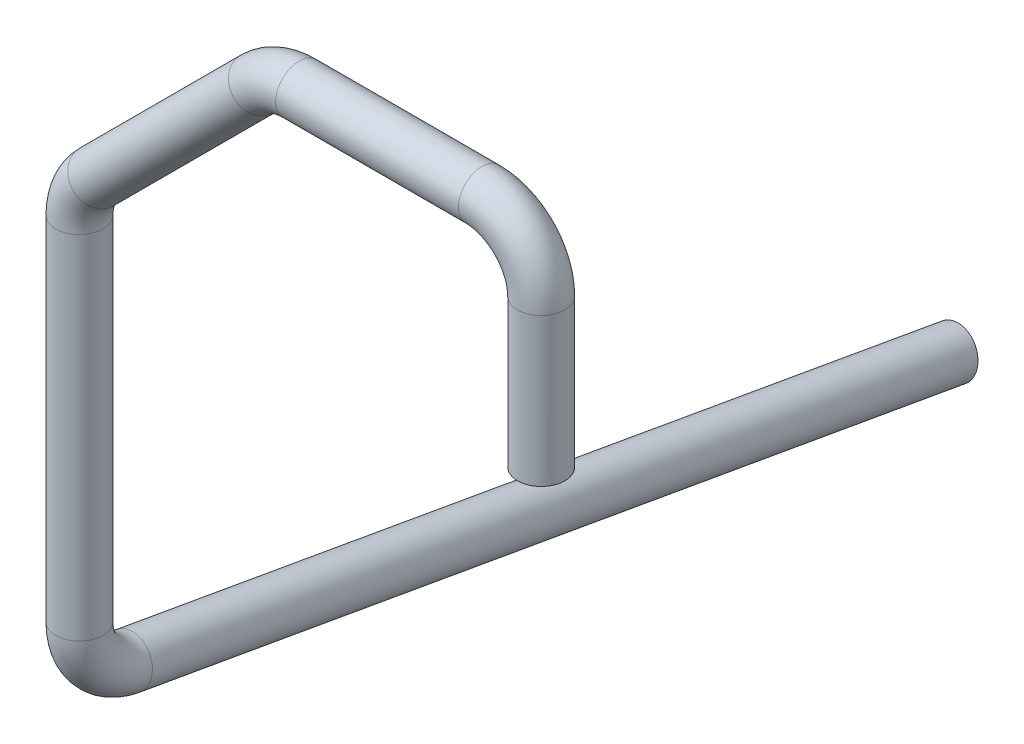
ISO-10303-21;
HEADER;
FILE_DESCRIPTION(('STEP AP214'),'2;1');
FILE_NAME('part.step','',(''),(''),'','','');
FILE_SCHEMA(('AUTOMOTIVE_DESIGN { 1 0 10303 214 1 1 1 1 }'));
ENDSEC;
DATA;
#1=APPLICATION_CONTEXT('core data for automotive mechanical design processes');
#2=APPLICATION_PROTOCOL_DEFINITION('international standard','automotive_design',2000,#1);
#3=PRODUCT_CONTEXT('',#1,'mechanical');
#4=PRODUCT('Part','Part','',(#3));
#5=PRODUCT_RELATED_PRODUCT_CATEGORY('part','',(#4));
#6=PRODUCT_DEFINITION_FORMATION('','',#4);
#7=PRODUCT_DEFINITION_CONTEXT('part definition',#1,'design');
#8=PRODUCT_DEFINITION('design','',#6,#7);
#9=PRODUCT_DEFINITION_SHAPE('','',#8);
#10=(LENGTH_UNIT() NAMED_UNIT(*) SI_UNIT(.MILLI.,.METRE.));
#11=(NAMED_UNIT(*) PLANE_ANGLE_UNIT() SI_UNIT($,.RADIAN.));
#12=(NAMED_UNIT(*) SI_UNIT($,.STERADIAN.) SOLID_ANGLE_UNIT());
#13=UNCERTAINTY_MEASURE_WITH_UNIT(LENGTH_MEASURE(1.E-05),#10,'distance_accuracy_value','');
#14=(GEOMETRIC_REPRESENTATION_CONTEXT(3) GLOBAL_UNCERTAINTY_ASSIGNED_CONTEXT((#13)) GLOBAL_UNIT_ASSIGNED_CONTEXT((#10,
#11,#12)) REPRESENTATION_CONTEXT('',''));
#15=CARTESIAN_POINT('',(0.,0.,0.));
#16=DIRECTION('',(0.,0.,1.));
#17=DIRECTION('',(1.,0.,0.));
#18=AXIS2_PLACEMENT_3D('',#15,#16,#17);
#19=CARTESIAN_POINT('',(0.,0.,0.));
#20=DIRECTION('',(0.,1.,0.));
#21=DIRECTION('',(0.,0.,1.));
#22=AXIS2_PLACEMENT_3D('',#19,#20,#21);
#23=CYLINDRICAL_SURFACE('',#22,4.);
#24=CARTESIAN_POINT('',(0.,24.9999999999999,0.));
#25=DIRECTION('',(0.,1.,0.));
#26=DIRECTION('',(0.,0.,1.));
#27=AXIS2_PLACEMENT_3D('',#24,#25,#26);
#28=CIRCLE('',#27,4.);
#29=CARTESIAN_POINT('',(4.,24.9999999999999,0.));
#30=VERTEX_POINT('',#29);
#31=EDGE_CURVE('E108',#30,#30,#28,.T.);
#32=ORIENTED_EDGE('',*,*,#31,.F.);
#33=EDGE_LOOP('',(#32));
#34=FACE_BOUND('',#33,.T.);
#35=CARTESIAN_POINT('',(0.,0.,0.));
#36=DIRECTION('',(0.,1.,0.));
#37=DIRECTION('',(0.,0.,1.));
#38=AXIS2_PLACEMENT_3D('',#35,#36,#37);
#39=CIRCLE('',#38,4.);
#40=CARTESIAN_POINT('',(0.,0.,3.99999999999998));
#41=VERTEX_POINT('',#40);
#42=EDGE_CURVE('E69',#41,#41,#39,.T.);
#43=ORIENTED_EDGE('',*,*,#42,.T.);
#44=EDGE_LOOP('',(#43));
#45=FACE_BOUND('',#44,.T.);
#46=ADVANCED_FACE('F50',(#34,#45),#23,.T.);
#47=CARTESIAN_POINT('',(-10.,25.,1.11022302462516E-13));
#48=DIRECTION('',(0.,0.,1.));
#49=DIRECTION('',(1.,0.,0.));
#50=AXIS2_PLACEMENT_3D('',#47,#48,#49);
#51=TOROIDAL_SURFACE('',#50,10.,4.);
#52=CARTESIAN_POINT('',(-10.0000000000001,35.,0.));
#53=DIRECTION('',(-1.,0.,0.));
#54=DIRECTION('',(0.,0.,1.));
#55=AXIS2_PLACEMENT_3D('',#52,#53,#54);
#56=CIRCLE('',#55,4.);
#57=CARTESIAN_POINT('',(-10.0000000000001,39.,0.));
#58=VERTEX_POINT('',#57);
#59=EDGE_CURVE('E112',#58,#58,#56,.T.);
#60=CARTESIAN_POINT('',(-10.,25.,1.11022302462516E-13));
#61=DIRECTION('',(0.,0.,1.));
#62=DIRECTION('',(1.,0.,0.));
#63=AXIS2_PLACEMENT_3D('',#60,#61,#62);
#64=CIRCLE('',#63,14.);
#65=EDGE_CURVE('',#30,#58,#64,.T.);
#66=ORIENTED_EDGE('',*,*,#31,.T.);
#67=ORIENTED_EDGE('',*,*,#59,.F.);
#68=ORIENTED_EDGE('',*,*,#65,.T.);
#69=ORIENTED_EDGE('',*,*,#65,.F.);
#70=EDGE_LOOP('',(#66,#68,#67,#69));
#71=FACE_BOUND('',#70,.T.);
#72=ADVANCED_FACE('F166',(#71),#51,.T.);
#73=CARTESIAN_POINT('',(-10.0000000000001,35.,0.));
#74=DIRECTION('',(-1.,0.,0.));
#75=DIRECTION('',(0.,0.,1.));
#76=AXIS2_PLACEMENT_3D('',#73,#74,#75);
#77=CYLINDRICAL_SURFACE('',#76,4.);
#78=CARTESIAN_POINT('',(-40.857864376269,34.9999999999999,0.));
#79=DIRECTION('',(-1.,0.,0.));
#80=DIRECTION('',(0.,0.,1.));
#81=AXIS2_PLACEMENT_3D('',#78,#79,#80);
#82=CIRCLE('',#81,4.);
#83=CARTESIAN_POINT('',(-40.857864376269,39.,0.));
#84=VERTEX_POINT('',#83);
#85=EDGE_CURVE('E115',#84,#84,#82,.T.);
#86=ORIENTED_EDGE('',*,*,#85,.F.);
#87=EDGE_LOOP('',(#86));
#88=FACE_BOUND('',#87,.T.);
#89=ORIENTED_EDGE('',*,*,#59,.T.);
#90=EDGE_LOOP('',(#89));
#91=FACE_BOUND('',#90,.T.);
#92=ADVANCED_FACE('F162',(#88,#91),#77,.T.);
#93=CARTESIAN_POINT('',(-40.857864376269,25.,1.66533453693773E-13));
#94=DIRECTION('',(0.,0.,1.));
#95=DIRECTION('',(1.,0.,0.));
#96=AXIS2_PLACEMENT_3D('',#93,#94,#95);
#97=TOROIDAL_SURFACE('',#96,10.,4.);
#98=CARTESIAN_POINT('',(-47.9289321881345,32.0710678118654,0.));
#99=DIRECTION('',(-0.707106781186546,-0.70710678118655,0.));
#100=DIRECTION('',(0.,0.,1.));
#101=AXIS2_PLACEMENT_3D('',#98,#99,#100);
#102=CIRCLE('',#101,4.);
#103=CARTESIAN_POINT('',(-50.7573593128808,34.8994949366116,0.));
#104=VERTEX_POINT('',#103);
#105=EDGE_CURVE('E119',#104,#104,#102,.T.);
#106=CARTESIAN_POINT('',(-40.857864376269,25.,1.66533453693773E-13));
#107=DIRECTION('',(0.,0.,1.));
#108=DIRECTION('',(1.,0.,0.));
#109=AXIS2_PLACEMENT_3D('',#106,#107,#108);
#110=CIRCLE('',#109,14.);
#111=EDGE_CURVE('',#84,#104,#110,.T.);
#112=ORIENTED_EDGE('',*,*,#85,.T.);
#113=ORIENTED_EDGE('',*,*,#105,.F.);
#114=ORIENTED_EDGE('',*,*,#111,.T.);
#115=ORIENTED_EDGE('',*,*,#111,.F.);
#116=EDGE_LOOP('',(#112,#114,#113,#115));
#117=FACE_BOUND('',#116,.T.);
#118=ADVANCED_FACE('F158',(#117),#97,.T.);
#119=CARTESIAN_POINT('',(-47.9289321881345,32.0710678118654,0.));
#120=DIRECTION('',(-0.707106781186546,-0.70710678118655,0.));
#121=DIRECTION('',(0.707106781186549,-0.707106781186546,0.));
#122=AXIS2_PLACEMENT_3D('',#119,#120,#121);
#123=CYLINDRICAL_SURFACE('',#122,4.);
#124=CARTESIAN_POINT('',(-75.0710678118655,4.92893218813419,0.));
#125=DIRECTION('',(-0.707106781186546,-0.70710678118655,0.));
#126=DIRECTION('',(0.,0.,1.));
#127=AXIS2_PLACEMENT_3D('',#124,#125,#126);
#128=CIRCLE('',#127,4.);
#129=CARTESIAN_POINT('',(-77.8994949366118,7.75735931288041,-1.27675647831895E-13));
#130=VERTEX_POINT('',#129);
#131=EDGE_CURVE('E123',#130,#130,#128,.T.);
#132=ORIENTED_EDGE('',*,*,#131,.F.);
#133=EDGE_LOOP('',(#132));
#134=FACE_BOUND('',#133,.T.);
#135=ORIENTED_EDGE('',*,*,#105,.T.);
#136=EDGE_LOOP('',(#135));
#137=FACE_BOUND('',#136,.T.);
#138=ADVANCED_FACE('F154',(#134,#137),#123,.T.);
#139=CARTESIAN_POINT('',(-68.,-2.14213562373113,0.));
#140=DIRECTION('',(0.,0.,1.));
#141=DIRECTION('',(1.,0.,0.));
#142=AXIS2_PLACEMENT_3D('',#139,#140,#141);
#143=TOROIDAL_SURFACE('',#142,10.,4.);
#144=CARTESIAN_POINT('',(-78.,-2.14213562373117,0.));
#145=DIRECTION('',(0.,-1.,0.));
#146=DIRECTION('',(0.,0.,1.));
#147=AXIS2_PLACEMENT_3D('',#144,#145,#146);
#148=CIRCLE('',#147,4.);
#149=CARTESIAN_POINT('',(-82.,-2.14213562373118,1.0547118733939E-13));
#150=VERTEX_POINT('',#149);
#151=EDGE_CURVE('E127',#150,#150,#148,.T.);
#152=CARTESIAN_POINT('',(-68.,-2.14213562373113,0.));
#153=DIRECTION('',(0.,0.,1.));
#154=DIRECTION('',(1.,0.,0.));
#155=AXIS2_PLACEMENT_3D('',#152,#153,#154);
#156=CIRCLE('',#155,14.);
#157=EDGE_CURVE('',#130,#150,#156,.T.);
#158=ORIENTED_EDGE('',*,*,#131,.T.);
#159=ORIENTED_EDGE('',*,*,#151,.F.);
#160=ORIENTED_EDGE('',*,*,#157,.T.);
#161=ORIENTED_EDGE('',*,*,#157,.F.);
#162=EDGE_LOOP('',(#158,#160,#159,#161));
#163=FACE_BOUND('',#162,.T.);
#164=ADVANCED_FACE('F148',(#163),#143,.T.);
#165=CARTESIAN_POINT('',(-78.,-2.14213562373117,0.));
#166=DIRECTION('',(0.,-1.,0.));
#167=DIRECTION('',(0.,0.,-1.));
#168=AXIS2_PLACEMENT_3D('',#165,#166,#167);
#169=CYLINDRICAL_SURFACE('',#168,4.);
#170=CARTESIAN_POINT('',(-78.,-61.6090036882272,1.38777878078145E-13));
#171=DIRECTION('',(0.,-1.,0.));
#172=DIRECTION('',(0.,0.,1.));
#173=AXIS2_PLACEMENT_3D('',#170,#171,#172);
#174=CIRCLE('',#173,4.);
#175=CARTESIAN_POINT('',(-78.0000000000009,-61.6090036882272,4.00000000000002));
#176=VERTEX_POINT('',#175);
#177=EDGE_CURVE('E130',#176,#176,#174,.T.);
#178=ORIENTED_EDGE('',*,*,#177,.F.);
#179=EDGE_LOOP('',(#178));
#180=FACE_BOUND('',#179,.T.);
#181=ORIENTED_EDGE('',*,*,#151,.T.);
#182=EDGE_LOOP('',(#181));
#183=FACE_BOUND('',#182,.T.);
#184=ADVANCED_FACE('F142',(#180,#183),#169,.T.);
#185=CARTESIAN_POINT('',(-77.9999999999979,-61.6090036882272,-9.99999999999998));
#186=DIRECTION('',(1.,0.,2.05370082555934E-13));
#187=DIRECTION('',(2.05412436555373E-13,0.,-1.));
#188=AXIS2_PLACEMENT_3D('',#185,#186,#187);
#189=TOROIDAL_SURFACE('',#188,10.,4.);
#190=CARTESIAN_POINT('',(-77.9999999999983,-71.4570812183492,-8.26351822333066));
#191=DIRECTION('',(2.02171608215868E-13,-0.17364817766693,-0.984807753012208));
#192=DIRECTION('',(1.69040349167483E-13,-0.984807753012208,0.17364817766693));
#193=AXIS2_PLACEMENT_3D('',#190,#191,#192);
#194=CIRCLE('',#193,4.);
#195=CARTESIAN_POINT('',(-77.9999999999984,-75.3963122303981,-7.56892551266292));
#196=VERTEX_POINT('',#195);
#197=EDGE_CURVE('E54',#196,#196,#194,.T.);
#198=CARTESIAN_POINT('',(-77.9999999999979,-61.6090036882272,-9.99999999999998));
#199=DIRECTION('',(1.,0.,2.05370082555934E-13));
#200=DIRECTION('',(2.05412436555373E-13,0.,-1.));
#201=AXIS2_PLACEMENT_3D('',#198,#199,#200);
#202=CIRCLE('',#201,14.);
#203=EDGE_CURVE('',#176,#196,#202,.T.);
#204=ORIENTED_EDGE('',*,*,#177,.T.);
#205=ORIENTED_EDGE('',*,*,#197,.F.);
#206=ORIENTED_EDGE('',*,*,#203,.T.);
#207=ORIENTED_EDGE('',*,*,#203,.F.);
#208=EDGE_LOOP('',(#204,#206,#205,#207));
#209=FACE_BOUND('',#208,.T.);
#210=ADVANCED_FACE('F140',(#209),#189,.T.);
#211=CARTESIAN_POINT('',(-77.9999999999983,-71.4570812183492,-8.26351822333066));
#212=DIRECTION('',(2.02392733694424E-13,-0.173648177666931,-0.984807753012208));
#213=DIRECTION('',(0.,0.984807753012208,-0.17364817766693));
#214=AXIS2_PLACEMENT_3D('',#211,#212,#213);
#215=CYLINDRICAL_SURFACE('',#214,4.);
#216=CARTESIAN_POINT('',(-77.9999999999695,-96.0472266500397,-147.721162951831));
#217=DIRECTION('',(2.02392733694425E-13,-0.173648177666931,-0.984807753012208));
#218=DIRECTION('',(1.69040349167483E-13,-0.984807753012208,0.17364817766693));
#219=AXIS2_PLACEMENT_3D('',#216,#217,#218);
#220=CIRCLE('',#219,4.);
#221=CARTESIAN_POINT('',(-77.9999999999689,-99.9864576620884,-147.026570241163));
#222=VERTEX_POINT('',#221);
#223=EDGE_CURVE('E75',#222,#222,#220,.T.);
#224=ORIENTED_EDGE('',*,*,#223,.F.);
#225=EDGE_LOOP('',(#224));
#226=FACE_BOUND('',#225,.T.);
#227=ORIENTED_EDGE('',*,*,#197,.T.);
#228=EDGE_LOOP('',(#227));
#229=FACE_BOUND('',#228,.T.);
#230=ADVANCED_FACE('F52',(#226,#229),#215,.T.);
#231=CARTESIAN_POINT('',(0.,0.,0.));
#232=DIRECTION('',(0.,1.,0.));
#233=DIRECTION('',(0.,0.,1.));
#234=AXIS2_PLACEMENT_3D('',#231,#232,#233);
#235=PLANE('',#234);
#236=CARTESIAN_POINT('',(0.,0.,0.));
#237=DIRECTION('',(0.,1.,0.));
#238=DIRECTION('',(0.,0.,1.));
#239=AXIS2_PLACEMENT_3D('',#236,#237,#238);
#240=CIRCLE('',#239,3.5);
#241=CARTESIAN_POINT('',(0.,0.,3.5));
#242=VERTEX_POINT('',#241);
#243=EDGE_CURVE('E105',#242,#242,#240,.F.);
#244=ORIENTED_EDGE('',*,*,#243,.F.);
#245=EDGE_LOOP('',(#244));
#246=FACE_BOUND('',#245,.T.);
#247=ORIENTED_EDGE('',*,*,#42,.F.);
#248=EDGE_LOOP('',(#247));
#249=FACE_BOUND('',#248,.T.);
#250=ADVANCED_FACE('F147',(#246,#249),#235,.F.);
#251=CARTESIAN_POINT('',(-77.9999999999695,-96.0472266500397,-147.721162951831));
#252=DIRECTION('',(2.02392733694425E-13,-0.173648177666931,-0.984807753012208));
#253=DIRECTION('',(1.69040349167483E-13,-0.984807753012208,0.17364817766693));
#254=AXIS2_PLACEMENT_3D('',#251,#252,#253);
#255=PLANE('',#254);
#256=CARTESIAN_POINT('',(-77.9999999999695,-96.0472266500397,-147.721162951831));
#257=DIRECTION('',(2.02392733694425E-13,-0.173648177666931,-0.984807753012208));
#258=DIRECTION('',(1.69040349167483E-13,-0.984807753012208,0.17364817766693));
#259=AXIS2_PLACEMENT_3D('',#256,#257,#258);
#260=CIRCLE('',#259,3.5);
#261=CARTESIAN_POINT('',(-77.9999999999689,-99.4940537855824,-147.113394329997));
#262=VERTEX_POINT('',#261);
#263=EDGE_CURVE('E13',#262,#262,#260,.F.);
#264=ORIENTED_EDGE('',*,*,#263,.T.);
#265=EDGE_LOOP('',(#264));
#266=FACE_BOUND('',#265,.T.);
#267=ORIENTED_EDGE('',*,*,#223,.T.);
#268=EDGE_LOOP('',(#267));
#269=FACE_BOUND('',#268,.T.);
#270=ADVANCED_FACE('F82',(#266,#269),#255,.T.);
#271=CARTESIAN_POINT('',(0.,0.,0.));
#272=DIRECTION('',(0.,1.,0.));
#273=DIRECTION('',(0.,0.,1.));
#274=AXIS2_PLACEMENT_3D('',#271,#272,#273);
#275=CYLINDRICAL_SURFACE('',#274,3.5);
#276=CARTESIAN_POINT('',(0.,24.9999999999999,0.));
#277=DIRECTION('',(0.,1.,0.));
#278=DIRECTION('',(0.,0.,1.));
#279=AXIS2_PLACEMENT_3D('',#276,#277,#278);
#280=CIRCLE('',#279,3.5);
#281=CARTESIAN_POINT('',(3.5,24.9999999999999,0.));
#282=VERTEX_POINT('',#281);
#283=EDGE_CURVE('E213',#282,#282,#280,.F.);
#284=ORIENTED_EDGE('',*,*,#283,.F.);
#285=EDGE_LOOP('',(#284));
#286=FACE_BOUND('',#285,.T.);
#287=ORIENTED_EDGE('',*,*,#243,.T.);
#288=EDGE_LOOP('',(#287));
#289=FACE_BOUND('',#288,.T.);
#290=ADVANCED_FACE('F178',(#286,#289),#275,.F.);
#291=CARTESIAN_POINT('',(-10.,25.,1.11022302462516E-13));
#292=DIRECTION('',(0.,0.,1.));
#293=DIRECTION('',(1.,0.,0.));
#294=AXIS2_PLACEMENT_3D('',#291,#292,#293);
#295=TOROIDAL_SURFACE('',#294,10.,3.5);
#296=CARTESIAN_POINT('',(-10.0000000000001,35.,0.));
#297=DIRECTION('',(-1.,0.,0.));
#298=DIRECTION('',(0.,0.,1.));
#299=AXIS2_PLACEMENT_3D('',#296,#297,#298);
#300=CIRCLE('',#299,3.5);
#301=CARTESIAN_POINT('',(-10.0000000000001,38.5,0.));
#302=VERTEX_POINT('',#301);
#303=EDGE_CURVE('E217',#302,#302,#300,.F.);
#304=CARTESIAN_POINT('',(-10.,25.,1.11022302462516E-13));
#305=DIRECTION('',(0.,0.,1.));
#306=DIRECTION('',(1.,0.,0.));
#307=AXIS2_PLACEMENT_3D('',#304,#305,#306);
#308=CIRCLE('',#307,13.5);
#309=EDGE_CURVE('',#282,#302,#308,.T.);
#310=ORIENTED_EDGE('',*,*,#283,.T.);
#311=ORIENTED_EDGE('',*,*,#303,.F.);
#312=ORIENTED_EDGE('',*,*,#309,.T.);
#313=ORIENTED_EDGE('',*,*,#309,.F.);
#314=EDGE_LOOP('',(#310,#312,#311,#313));
#315=FACE_BOUND('',#314,.T.);
#316=ADVANCED_FACE('F201',(#315),#295,.F.);
#317=CARTESIAN_POINT('',(-10.0000000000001,35.,0.));
#318=DIRECTION('',(-1.,0.,0.));
#319=DIRECTION('',(0.,0.,1.));
#320=AXIS2_PLACEMENT_3D('',#317,#318,#319);
#321=CYLINDRICAL_SURFACE('',#320,3.5);
#322=CARTESIAN_POINT('',(-40.857864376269,34.9999999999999,0.));
#323=DIRECTION('',(-1.,0.,0.));
#324=DIRECTION('',(0.,0.,1.));
#325=AXIS2_PLACEMENT_3D('',#322,#323,#324);
#326=CIRCLE('',#325,3.5);
#327=CARTESIAN_POINT('',(-40.857864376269,38.5,0.));
#328=VERTEX_POINT('',#327);
#329=EDGE_CURVE('E222',#328,#328,#326,.F.);
#330=ORIENTED_EDGE('',*,*,#329,.F.);
#331=EDGE_LOOP('',(#330));
#332=FACE_BOUND('',#331,.T.);
#333=ORIENTED_EDGE('',*,*,#303,.T.);
#334=EDGE_LOOP('',(#333));
#335=FACE_BOUND('',#334,.T.);
#336=ADVANCED_FACE('F197',(#332,#335),#321,.F.);
#337=CARTESIAN_POINT('',(-40.857864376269,25.,1.66533453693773E-13));
#338=DIRECTION('',(0.,0.,1.));
#339=DIRECTION('',(1.,0.,0.));
#340=AXIS2_PLACEMENT_3D('',#337,#338,#339);
#341=TOROIDAL_SURFACE('',#340,10.,3.5);
#342=CARTESIAN_POINT('',(-47.9289321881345,32.0710678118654,0.));
#343=DIRECTION('',(-0.707106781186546,-0.70710678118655,0.));
#344=DIRECTION('',(0.,0.,1.));
#345=AXIS2_PLACEMENT_3D('',#342,#343,#344);
#346=CIRCLE('',#345,3.5);
#347=CARTESIAN_POINT('',(-50.4038059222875,34.5459415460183,0.));
#348=VERTEX_POINT('',#347);
#349=EDGE_CURVE('E226',#348,#348,#346,.F.);
#350=CARTESIAN_POINT('',(-40.857864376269,25.,1.66533453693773E-13));
#351=DIRECTION('',(0.,0.,1.));
#352=DIRECTION('',(1.,0.,0.));
#353=AXIS2_PLACEMENT_3D('',#350,#351,#352);
#354=CIRCLE('',#353,13.5);
#355=EDGE_CURVE('',#328,#348,#354,.T.);
#356=ORIENTED_EDGE('',*,*,#329,.T.);
#357=ORIENTED_EDGE('',*,*,#349,.F.);
#358=ORIENTED_EDGE('',*,*,#355,.T.);
#359=ORIENTED_EDGE('',*,*,#355,.F.);
#360=EDGE_LOOP('',(#356,#358,#357,#359));
#361=FACE_BOUND('',#360,.T.);
#362=ADVANCED_FACE('F193',(#361),#341,.F.);
#363=CARTESIAN_POINT('',(-47.9289321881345,32.0710678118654,0.));
#364=DIRECTION('',(-0.707106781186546,-0.70710678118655,0.));
#365=DIRECTION('',(0.707106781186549,-0.707106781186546,0.));
#366=AXIS2_PLACEMENT_3D('',#363,#364,#365);
#367=CYLINDRICAL_SURFACE('',#366,3.5);
#368=CARTESIAN_POINT('',(-75.0710678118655,4.92893218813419,0.));
#369=DIRECTION('',(-0.707106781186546,-0.70710678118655,0.));
#370=DIRECTION('',(0.,0.,1.));
#371=AXIS2_PLACEMENT_3D('',#368,#369,#370);
#372=CIRCLE('',#371,3.5);
#373=CARTESIAN_POINT('',(-77.5459415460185,7.40380592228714,-1.22124532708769E-13));
#374=VERTEX_POINT('',#373);
#375=EDGE_CURVE('E230',#374,#374,#372,.F.);
#376=ORIENTED_EDGE('',*,*,#375,.F.);
#377=EDGE_LOOP('',(#376));
#378=FACE_BOUND('',#377,.T.);
#379=ORIENTED_EDGE('',*,*,#349,.T.);
#380=EDGE_LOOP('',(#379));
#381=FACE_BOUND('',#380,.T.);
#382=ADVANCED_FACE('F189',(#378,#381),#367,.F.);
#383=CARTESIAN_POINT('',(-68.,-2.14213562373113,0.));
#384=DIRECTION('',(0.,0.,1.));
#385=DIRECTION('',(1.,0.,0.));
#386=AXIS2_PLACEMENT_3D('',#383,#384,#385);
#387=TOROIDAL_SURFACE('',#386,10.,3.5);
#388=CARTESIAN_POINT('',(-78.,-2.14213562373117,0.));
#389=DIRECTION('',(0.,-1.,0.));
#390=DIRECTION('',(0.,0.,1.));
#391=AXIS2_PLACEMENT_3D('',#388,#389,#390);
#392=CIRCLE('',#391,3.5);
#393=CARTESIAN_POINT('',(-81.5,-2.14213562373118,1.02695629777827E-13));
#394=VERTEX_POINT('',#393);
#395=EDGE_CURVE('E99',#394,#394,#392,.F.);
#396=CARTESIAN_POINT('',(-68.,-2.14213562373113,0.));
#397=DIRECTION('',(0.,0.,1.));
#398=DIRECTION('',(1.,0.,0.));
#399=AXIS2_PLACEMENT_3D('',#396,#397,#398);
#400=CIRCLE('',#399,13.5);
#401=EDGE_CURVE('',#374,#394,#400,.T.);
#402=ORIENTED_EDGE('',*,*,#375,.T.);
#403=ORIENTED_EDGE('',*,*,#395,.F.);
#404=ORIENTED_EDGE('',*,*,#401,.T.);
#405=ORIENTED_EDGE('',*,*,#401,.F.);
#406=EDGE_LOOP('',(#402,#404,#403,#405));
#407=FACE_BOUND('',#406,.T.);
#408=ADVANCED_FACE('F185',(#407),#387,.F.);
#409=CARTESIAN_POINT('',(-78.,-2.14213562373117,0.));
#410=DIRECTION('',(0.,-1.,0.));
#411=DIRECTION('',(0.,0.,-1.));
#412=AXIS2_PLACEMENT_3D('',#409,#410,#411);
#413=CYLINDRICAL_SURFACE('',#412,3.5);
#414=CARTESIAN_POINT('',(-78.,-61.6090036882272,1.38777878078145E-13));
#415=DIRECTION('',(0.,-1.,0.));
#416=DIRECTION('',(0.,0.,1.));
#417=AXIS2_PLACEMENT_3D('',#414,#415,#416);
#418=CIRCLE('',#417,3.5);
#419=CARTESIAN_POINT('',(-78.0000000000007,-61.6090036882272,3.50000000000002));
#420=VERTEX_POINT('',#419);
#421=EDGE_CURVE('E94',#420,#420,#418,.F.);
#422=ORIENTED_EDGE('',*,*,#421,.F.);
#423=EDGE_LOOP('',(#422));
#424=FACE_BOUND('',#423,.T.);
#425=ORIENTED_EDGE('',*,*,#395,.T.);
#426=EDGE_LOOP('',(#425));
#427=FACE_BOUND('',#426,.T.);
#428=ADVANCED_FACE('F182',(#424,#427),#413,.F.);
#429=CARTESIAN_POINT('',(-77.9999999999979,-61.6090036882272,-9.99999999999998));
#430=DIRECTION('',(1.,0.,2.05370082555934E-13));
#431=DIRECTION('',(2.05412436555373E-13,0.,-1.));
#432=AXIS2_PLACEMENT_3D('',#429,#430,#431);
#433=TOROIDAL_SURFACE('',#432,10.,3.5);
#434=CARTESIAN_POINT('',(-77.9999999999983,-71.4570812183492,-8.26351822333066));
#435=DIRECTION('',(2.02171608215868E-13,-0.17364817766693,-0.984807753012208));
#436=DIRECTION('',(1.69040349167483E-13,-0.984807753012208,0.17364817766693));
#437=AXIS2_PLACEMENT_3D('',#434,#435,#436);
#438=CIRCLE('',#437,3.5);
#439=CARTESIAN_POINT('',(-77.9999999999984,-74.903908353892,-7.65574960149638));
#440=VERTEX_POINT('',#439);
#441=EDGE_CURVE('E60',#440,#440,#438,.F.);
#442=CARTESIAN_POINT('',(-77.9999999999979,-61.6090036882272,-9.99999999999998));
#443=DIRECTION('',(1.,0.,2.05370082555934E-13));
#444=DIRECTION('',(2.05412436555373E-13,0.,-1.));
#445=AXIS2_PLACEMENT_3D('',#442,#443,#444);
#446=CIRCLE('',#445,13.5);
#447=EDGE_CURVE('',#420,#440,#446,.T.);
#448=ORIENTED_EDGE('',*,*,#421,.T.);
#449=ORIENTED_EDGE('',*,*,#441,.F.);
#450=ORIENTED_EDGE('',*,*,#447,.T.);
#451=ORIENTED_EDGE('',*,*,#447,.F.);
#452=EDGE_LOOP('',(#448,#450,#449,#451));
#453=FACE_BOUND('',#452,.T.);
#454=ADVANCED_FACE('F88',(#453),#433,.F.);
#455=CARTESIAN_POINT('',(-77.9999999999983,-71.4570812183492,-8.26351822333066));
#456=DIRECTION('',(2.02392733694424E-13,-0.173648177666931,-0.984807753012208));
#457=DIRECTION('',(0.,0.984807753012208,-0.17364817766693));
#458=AXIS2_PLACEMENT_3D('',#455,#456,#457);
#459=CYLINDRICAL_SURFACE('',#458,3.5);
#460=ORIENTED_EDGE('',*,*,#263,.F.);
#461=EDGE_LOOP('',(#460));
#462=FACE_BOUND('',#461,.T.);
#463=ORIENTED_EDGE('',*,*,#441,.T.);
#464=EDGE_LOOP('',(#463));
#465=FACE_BOUND('',#464,.T.);
#466=ADVANCED_FACE('F85',(#462,#465),#459,.F.);
#467=CLOSED_SHELL('',(#46,#72,#92,#118,#138,#164,#184,#210,#230,#250,#270,#290,#316,#336,#362,
#382,#408,#428,#454,#466));
#468=MANIFOLD_SOLID_BREP('B2',#467);
#469=ADVANCED_BREP_SHAPE_REPRESENTATION('',(#18,#468),#14);
#470=SHAPE_DEFINITION_REPRESENTATION(#9,#469);
ENDSEC;
END-ISO-10303-21;
